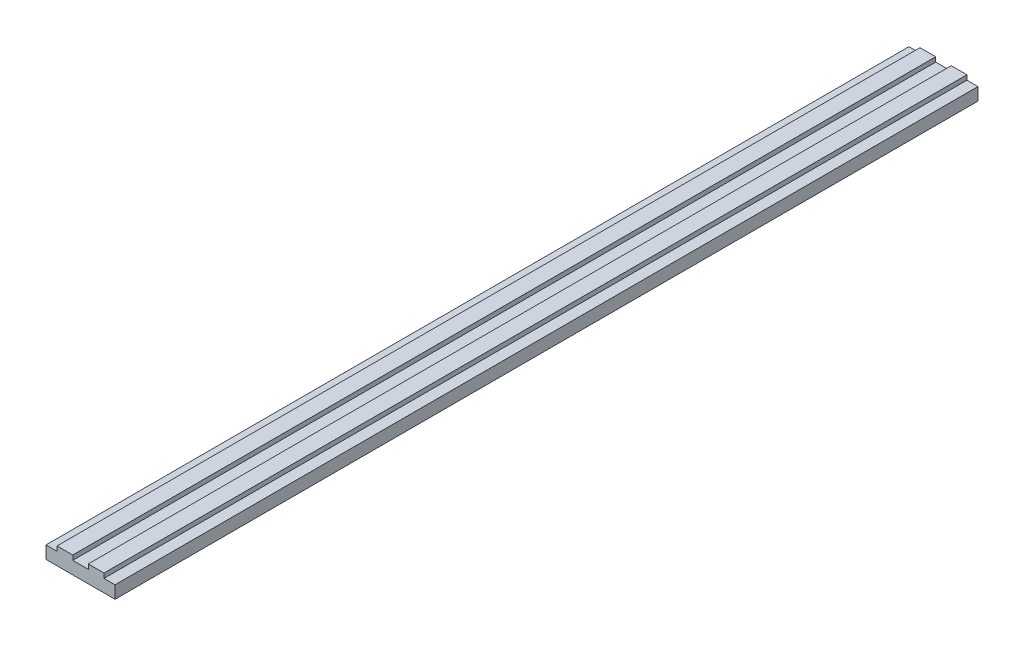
ISO-10303-21;
HEADER;
FILE_DESCRIPTION(('STEP AP214'),'2;1');
FILE_NAME('part.step','',(''),(''),'','','');
FILE_SCHEMA(('AUTOMOTIVE_DESIGN { 1 0 10303 214 1 1 1 1 }'));
ENDSEC;
DATA;
#1=APPLICATION_CONTEXT('core data for automotive mechanical design processes');
#2=APPLICATION_PROTOCOL_DEFINITION('international standard','automotive_design',2000,#1);
#3=PRODUCT_CONTEXT('',#1,'mechanical');
#4=PRODUCT('Part','Part','',(#3));
#5=PRODUCT_RELATED_PRODUCT_CATEGORY('part','',(#4));
#6=PRODUCT_DEFINITION_FORMATION('','',#4);
#7=PRODUCT_DEFINITION_CONTEXT('part definition',#1,'design');
#8=PRODUCT_DEFINITION('design','',#6,#7);
#9=PRODUCT_DEFINITION_SHAPE('','',#8);
#10=(LENGTH_UNIT() NAMED_UNIT(*) SI_UNIT(.MILLI.,.METRE.));
#11=(NAMED_UNIT(*) PLANE_ANGLE_UNIT() SI_UNIT($,.RADIAN.));
#12=(NAMED_UNIT(*) SI_UNIT($,.STERADIAN.) SOLID_ANGLE_UNIT());
#13=UNCERTAINTY_MEASURE_WITH_UNIT(LENGTH_MEASURE(1.E-05),#10,'distance_accuracy_value','');
#14=(GEOMETRIC_REPRESENTATION_CONTEXT(3) GLOBAL_UNCERTAINTY_ASSIGNED_CONTEXT((#13)) GLOBAL_UNIT_ASSIGNED_CONTEXT((#10,
#11,#12)) REPRESENTATION_CONTEXT('',''));
#15=CARTESIAN_POINT('',(0.,0.,0.));
#16=DIRECTION('',(0.,0.,1.));
#17=DIRECTION('',(1.,0.,0.));
#18=AXIS2_PLACEMENT_3D('',#15,#16,#17);
#19=CARTESIAN_POINT('',(4.5,10.,0.));
#20=DIRECTION('',(-1.,0.,0.));
#21=DIRECTION('',(0.,0.,1.));
#22=AXIS2_PLACEMENT_3D('',#19,#20,#21);
#23=PLANE('',#22);
#24=DIRECTION('',(0.,-1.,0.));
#25=VECTOR('',#24,1.);
#26=CARTESIAN_POINT('',(4.5,10.,500.));
#27=LINE('',#26,#25);
#28=CARTESIAN_POINT('',(4.5,10.,500.));
#29=VERTEX_POINT('',#28);
#30=CARTESIAN_POINT('',(4.5,7.3,500.));
#31=VERTEX_POINT('',#30);
#32=EDGE_CURVE('E135',#29,#31,#27,.T.);
#33=ORIENTED_EDGE('',*,*,#32,.F.);
#34=DIRECTION('',(0.,0.,1.));
#35=VECTOR('',#34,1.);
#36=CARTESIAN_POINT('',(4.5,10.,0.));
#37=LINE('',#36,#35);
#38=CARTESIAN_POINT('',(4.5,10.,0.));
#39=VERTEX_POINT('',#38);
#40=EDGE_CURVE('E9',#39,#29,#37,.T.);
#41=ORIENTED_EDGE('',*,*,#40,.F.);
#42=DIRECTION('',(0.,-1.,0.));
#43=VECTOR('',#42,1.);
#44=CARTESIAN_POINT('',(4.5,10.,0.));
#45=LINE('',#44,#43);
#46=CARTESIAN_POINT('',(4.5,7.3,0.));
#47=VERTEX_POINT('',#46);
#48=EDGE_CURVE('E163',#39,#47,#45,.T.);
#49=ORIENTED_EDGE('',*,*,#48,.T.);
#50=DIRECTION('',(0.,0.,1.));
#51=VECTOR('',#50,1.);
#52=CARTESIAN_POINT('',(4.5,7.3,0.));
#53=LINE('',#52,#51);
#54=EDGE_CURVE('E17',#47,#31,#53,.T.);
#55=ORIENTED_EDGE('',*,*,#54,.T.);
#56=EDGE_LOOP('',(#33,#41,#49,#55));
#57=FACE_BOUND('',#56,.T.);
#58=ADVANCED_FACE('F14',(#57),#23,.T.);
#59=CARTESIAN_POINT('',(4.5,10.,0.));
#60=DIRECTION('',(0.,-1.,0.));
#61=DIRECTION('',(0.,0.,-1.));
#62=AXIS2_PLACEMENT_3D('',#59,#60,#61);
#63=PLANE('',#62);
#64=DIRECTION('',(1.,0.,0.));
#65=VECTOR('',#64,1.);
#66=CARTESIAN_POINT('',(4.5,10.,500.));
#67=LINE('',#66,#65);
#68=CARTESIAN_POINT('',(13.6,10.,500.));
#69=VERTEX_POINT('',#68);
#70=EDGE_CURVE('E71',#29,#69,#67,.T.);
#71=ORIENTED_EDGE('',*,*,#70,.T.);
#72=DIRECTION('',(0.,0.,1.));
#73=VECTOR('',#72,1.);
#74=CARTESIAN_POINT('',(13.6,10.,0.));
#75=LINE('',#74,#73);
#76=CARTESIAN_POINT('',(13.6,10.,0.));
#77=VERTEX_POINT('',#76);
#78=EDGE_CURVE('E23',#77,#69,#75,.T.);
#79=ORIENTED_EDGE('',*,*,#78,.F.);
#80=DIRECTION('',(1.,0.,0.));
#81=VECTOR('',#80,1.);
#82=CARTESIAN_POINT('',(4.5,10.,0.));
#83=LINE('',#82,#81);
#84=EDGE_CURVE('E113',#39,#77,#83,.T.);
#85=ORIENTED_EDGE('',*,*,#84,.F.);
#86=ORIENTED_EDGE('',*,*,#40,.T.);
#87=EDGE_LOOP('',(#71,#79,#85,#86));
#88=FACE_BOUND('',#87,.T.);
#89=ADVANCED_FACE('F242',(#88),#63,.F.);
#90=CARTESIAN_POINT('',(13.6,10.,0.));
#91=DIRECTION('',(-1.,0.,0.));
#92=DIRECTION('',(0.,0.,1.));
#93=AXIS2_PLACEMENT_3D('',#90,#91,#92);
#94=PLANE('',#93);
#95=DIRECTION('',(0.,-1.,0.));
#96=VECTOR('',#95,1.);
#97=CARTESIAN_POINT('',(13.6,10.,500.));
#98=LINE('',#97,#96);
#99=CARTESIAN_POINT('',(13.6,7.3,500.));
#100=VERTEX_POINT('',#99);
#101=EDGE_CURVE('E120',#69,#100,#98,.T.);
#102=ORIENTED_EDGE('',*,*,#101,.T.);
#103=DIRECTION('',(0.,0.,1.));
#104=VECTOR('',#103,1.);
#105=CARTESIAN_POINT('',(13.6,7.3,0.));
#106=LINE('',#105,#104);
#107=CARTESIAN_POINT('',(13.6,7.3,0.));
#108=VERTEX_POINT('',#107);
#109=EDGE_CURVE('E117',#108,#100,#106,.T.);
#110=ORIENTED_EDGE('',*,*,#109,.F.);
#111=DIRECTION('',(0.,-1.,0.));
#112=VECTOR('',#111,1.);
#113=CARTESIAN_POINT('',(13.6,10.,0.));
#114=LINE('',#113,#112);
#115=EDGE_CURVE('E107',#77,#108,#114,.T.);
#116=ORIENTED_EDGE('',*,*,#115,.F.);
#117=ORIENTED_EDGE('',*,*,#78,.T.);
#118=EDGE_LOOP('',(#102,#110,#116,#117));
#119=FACE_BOUND('',#118,.T.);
#120=ADVANCED_FACE('F118',(#119),#94,.F.);
#121=CARTESIAN_POINT('',(13.6,7.3,0.));
#122=DIRECTION('',(0.,-1.,0.));
#123=DIRECTION('',(0.,0.,-1.));
#124=AXIS2_PLACEMENT_3D('',#121,#122,#123);
#125=PLANE('',#124);
#126=DIRECTION('',(1.,0.,0.));
#127=VECTOR('',#126,1.);
#128=CARTESIAN_POINT('',(13.6,7.3,500.));
#129=LINE('',#128,#127);
#130=CARTESIAN_POINT('',(20.,7.3,500.));
#131=VERTEX_POINT('',#130);
#132=EDGE_CURVE('E160',#100,#131,#129,.T.);
#133=ORIENTED_EDGE('',*,*,#132,.T.);
#134=DIRECTION('',(0.,0.,1.));
#135=VECTOR('',#134,1.);
#136=CARTESIAN_POINT('',(20.,7.3,0.));
#137=LINE('',#136,#135);
#138=CARTESIAN_POINT('',(20.,7.3,0.));
#139=VERTEX_POINT('',#138);
#140=EDGE_CURVE('E123',#139,#131,#137,.T.);
#141=ORIENTED_EDGE('',*,*,#140,.F.);
#142=DIRECTION('',(1.,0.,0.));
#143=VECTOR('',#142,1.);
#144=CARTESIAN_POINT('',(13.6,7.3,0.));
#145=LINE('',#144,#143);
#146=EDGE_CURVE('E111',#108,#139,#145,.T.);
#147=ORIENTED_EDGE('',*,*,#146,.F.);
#148=ORIENTED_EDGE('',*,*,#109,.T.);
#149=EDGE_LOOP('',(#133,#141,#147,#148));
#150=FACE_BOUND('',#149,.T.);
#151=ADVANCED_FACE('F125',(#150),#125,.F.);
#152=CARTESIAN_POINT('',(20.,7.3,0.));
#153=DIRECTION('',(-1.,0.,0.));
#154=DIRECTION('',(0.,0.,1.));
#155=AXIS2_PLACEMENT_3D('',#152,#153,#154);
#156=PLANE('',#155);
#157=DIRECTION('',(0.,-1.,0.));
#158=VECTOR('',#157,1.);
#159=CARTESIAN_POINT('',(20.,7.3,500.));
#160=LINE('',#159,#158);
#161=CARTESIAN_POINT('',(20.,0.,500.));
#162=VERTEX_POINT('',#161);
#163=EDGE_CURVE('E157',#131,#162,#160,.T.);
#164=ORIENTED_EDGE('',*,*,#163,.T.);
#165=DIRECTION('',(0.,0.,1.));
#166=VECTOR('',#165,1.);
#167=CARTESIAN_POINT('',(20.,0.,0.));
#168=LINE('',#167,#166);
#169=CARTESIAN_POINT('',(20.,0.,0.));
#170=VERTEX_POINT('',#169);
#171=EDGE_CURVE('E167',#170,#162,#168,.T.);
#172=ORIENTED_EDGE('',*,*,#171,.F.);
#173=DIRECTION('',(0.,-1.,0.));
#174=VECTOR('',#173,1.);
#175=CARTESIAN_POINT('',(20.,7.3,0.));
#176=LINE('',#175,#174);
#177=EDGE_CURVE('E128',#139,#170,#176,.T.);
#178=ORIENTED_EDGE('',*,*,#177,.F.);
#179=ORIENTED_EDGE('',*,*,#140,.T.);
#180=EDGE_LOOP('',(#164,#172,#178,#179));
#181=FACE_BOUND('',#180,.T.);
#182=ADVANCED_FACE('F190',(#181),#156,.F.);
#183=CARTESIAN_POINT('',(-20.,0.,0.));
#184=DIRECTION('',(0.,-1.,0.));
#185=DIRECTION('',(0.,0.,-1.));
#186=AXIS2_PLACEMENT_3D('',#183,#184,#185);
#187=PLANE('',#186);
#188=DIRECTION('',(1.,0.,0.));
#189=VECTOR('',#188,1.);
#190=CARTESIAN_POINT('',(-20.,0.,500.));
#191=LINE('',#190,#189);
#192=CARTESIAN_POINT('',(-20.,0.,500.));
#193=VERTEX_POINT('',#192);
#194=EDGE_CURVE('E154',#193,#162,#191,.T.);
#195=ORIENTED_EDGE('',*,*,#194,.F.);
#196=DIRECTION('',(0.,0.,1.));
#197=VECTOR('',#196,1.);
#198=CARTESIAN_POINT('',(-20.,0.,0.));
#199=LINE('',#198,#197);
#200=CARTESIAN_POINT('',(-20.,0.,0.));
#201=VERTEX_POINT('',#200);
#202=EDGE_CURVE('E169',#201,#193,#199,.T.);
#203=ORIENTED_EDGE('',*,*,#202,.F.);
#204=DIRECTION('',(1.,0.,0.));
#205=VECTOR('',#204,1.);
#206=CARTESIAN_POINT('',(-20.,0.,0.));
#207=LINE('',#206,#205);
#208=EDGE_CURVE('E130',#201,#170,#207,.T.);
#209=ORIENTED_EDGE('',*,*,#208,.T.);
#210=ORIENTED_EDGE('',*,*,#171,.T.);
#211=EDGE_LOOP('',(#195,#203,#209,#210));
#212=FACE_BOUND('',#211,.T.);
#213=ADVANCED_FACE('F230',(#212),#187,.T.);
#214=CARTESIAN_POINT('',(-20.,7.3,0.));
#215=DIRECTION('',(-1.,0.,0.));
#216=DIRECTION('',(0.,0.,1.));
#217=AXIS2_PLACEMENT_3D('',#214,#215,#216);
#218=PLANE('',#217);
#219=DIRECTION('',(0.,-1.,0.));
#220=VECTOR('',#219,1.);
#221=CARTESIAN_POINT('',(-20.,7.3,500.));
#222=LINE('',#221,#220);
#223=CARTESIAN_POINT('',(-20.,7.3,500.));
#224=VERTEX_POINT('',#223);
#225=EDGE_CURVE('E151',#224,#193,#222,.T.);
#226=ORIENTED_EDGE('',*,*,#225,.F.);
#227=DIRECTION('',(0.,0.,1.));
#228=VECTOR('',#227,1.);
#229=CARTESIAN_POINT('',(-20.,7.3,0.));
#230=LINE('',#229,#228);
#231=CARTESIAN_POINT('',(-20.,7.3,0.));
#232=VERTEX_POINT('',#231);
#233=EDGE_CURVE('E171',#232,#224,#230,.T.);
#234=ORIENTED_EDGE('',*,*,#233,.F.);
#235=DIRECTION('',(0.,-1.,0.));
#236=VECTOR('',#235,1.);
#237=CARTESIAN_POINT('',(-20.,7.3,0.));
#238=LINE('',#237,#236);
#239=EDGE_CURVE('E196',#232,#201,#238,.T.);
#240=ORIENTED_EDGE('',*,*,#239,.T.);
#241=ORIENTED_EDGE('',*,*,#202,.T.);
#242=EDGE_LOOP('',(#226,#234,#240,#241));
#243=FACE_BOUND('',#242,.T.);
#244=ADVANCED_FACE('F200',(#243),#218,.T.);
#245=CARTESIAN_POINT('',(-20.,7.3,0.));
#246=DIRECTION('',(0.,-1.,0.));
#247=DIRECTION('',(0.,0.,-1.));
#248=AXIS2_PLACEMENT_3D('',#245,#246,#247);
#249=PLANE('',#248);
#250=DIRECTION('',(1.,0.,0.));
#251=VECTOR('',#250,1.);
#252=CARTESIAN_POINT('',(-20.,7.3,500.));
#253=LINE('',#252,#251);
#254=CARTESIAN_POINT('',(-13.6,7.3,500.));
#255=VERTEX_POINT('',#254);
#256=EDGE_CURVE('E148',#224,#255,#253,.T.);
#257=ORIENTED_EDGE('',*,*,#256,.T.);
#258=DIRECTION('',(0.,0.,1.));
#259=VECTOR('',#258,1.);
#260=CARTESIAN_POINT('',(-13.6,7.3,0.));
#261=LINE('',#260,#259);
#262=CARTESIAN_POINT('',(-13.6,7.3,0.));
#263=VERTEX_POINT('',#262);
#264=EDGE_CURVE('E173',#263,#255,#261,.T.);
#265=ORIENTED_EDGE('',*,*,#264,.F.);
#266=DIRECTION('',(1.,0.,0.));
#267=VECTOR('',#266,1.);
#268=CARTESIAN_POINT('',(-20.,7.3,0.));
#269=LINE('',#268,#267);
#270=EDGE_CURVE('E203',#232,#263,#269,.T.);
#271=ORIENTED_EDGE('',*,*,#270,.F.);
#272=ORIENTED_EDGE('',*,*,#233,.T.);
#273=EDGE_LOOP('',(#257,#265,#271,#272));
#274=FACE_BOUND('',#273,.T.);
#275=ADVANCED_FACE('F229',(#274),#249,.F.);
#276=CARTESIAN_POINT('',(-13.6,10.,0.));
#277=DIRECTION('',(-1.,0.,0.));
#278=DIRECTION('',(0.,0.,1.));
#279=AXIS2_PLACEMENT_3D('',#276,#277,#278);
#280=PLANE('',#279);
#281=DIRECTION('',(0.,-1.,0.));
#282=VECTOR('',#281,1.);
#283=CARTESIAN_POINT('',(-13.6,10.,500.));
#284=LINE('',#283,#282);
#285=CARTESIAN_POINT('',(-13.6,10.,500.));
#286=VERTEX_POINT('',#285);
#287=EDGE_CURVE('E145',#286,#255,#284,.T.);
#288=ORIENTED_EDGE('',*,*,#287,.F.);
#289=DIRECTION('',(0.,0.,1.));
#290=VECTOR('',#289,1.);
#291=CARTESIAN_POINT('',(-13.6,10.,0.));
#292=LINE('',#291,#290);
#293=CARTESIAN_POINT('',(-13.6,10.,0.));
#294=VERTEX_POINT('',#293);
#295=EDGE_CURVE('E175',#294,#286,#292,.T.);
#296=ORIENTED_EDGE('',*,*,#295,.F.);
#297=DIRECTION('',(0.,-1.,0.));
#298=VECTOR('',#297,1.);
#299=CARTESIAN_POINT('',(-13.6,10.,0.));
#300=LINE('',#299,#298);
#301=EDGE_CURVE('E205',#294,#263,#300,.T.);
#302=ORIENTED_EDGE('',*,*,#301,.T.);
#303=ORIENTED_EDGE('',*,*,#264,.T.);
#304=EDGE_LOOP('',(#288,#296,#302,#303));
#305=FACE_BOUND('',#304,.T.);
#306=ADVANCED_FACE('F226',(#305),#280,.T.);
#307=CARTESIAN_POINT('',(-13.6,10.,0.));
#308=DIRECTION('',(0.,-1.,0.));
#309=DIRECTION('',(0.,0.,-1.));
#310=AXIS2_PLACEMENT_3D('',#307,#308,#309);
#311=PLANE('',#310);
#312=DIRECTION('',(1.,0.,0.));
#313=VECTOR('',#312,1.);
#314=CARTESIAN_POINT('',(-13.6,10.,500.));
#315=LINE('',#314,#313);
#316=CARTESIAN_POINT('',(-4.49999999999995,10.,500.));
#317=VERTEX_POINT('',#316);
#318=EDGE_CURVE('E143',#286,#317,#315,.T.);
#319=ORIENTED_EDGE('',*,*,#318,.T.);
#320=DIRECTION('',(0.,0.,1.));
#321=VECTOR('',#320,1.);
#322=CARTESIAN_POINT('',(-4.49999999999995,10.,0.));
#323=LINE('',#322,#321);
#324=CARTESIAN_POINT('',(-4.49999999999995,10.,0.));
#325=VERTEX_POINT('',#324);
#326=EDGE_CURVE('E177',#325,#317,#323,.T.);
#327=ORIENTED_EDGE('',*,*,#326,.F.);
#328=DIRECTION('',(1.,0.,0.));
#329=VECTOR('',#328,1.);
#330=CARTESIAN_POINT('',(-13.6,10.,0.));
#331=LINE('',#330,#329);
#332=EDGE_CURVE('E210',#294,#325,#331,.T.);
#333=ORIENTED_EDGE('',*,*,#332,.F.);
#334=ORIENTED_EDGE('',*,*,#295,.T.);
#335=EDGE_LOOP('',(#319,#327,#333,#334));
#336=FACE_BOUND('',#335,.T.);
#337=ADVANCED_FACE('F309',(#336),#311,.F.);
#338=CARTESIAN_POINT('',(-4.49999999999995,10.,0.));
#339=DIRECTION('',(-1.,0.,0.));
#340=DIRECTION('',(0.,0.,1.));
#341=AXIS2_PLACEMENT_3D('',#338,#339,#340);
#342=PLANE('',#341);
#343=DIRECTION('',(0.,-1.,0.));
#344=VECTOR('',#343,1.);
#345=CARTESIAN_POINT('',(-4.49999999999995,10.,500.));
#346=LINE('',#345,#344);
#347=CARTESIAN_POINT('',(-4.49999999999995,7.3,500.));
#348=VERTEX_POINT('',#347);
#349=EDGE_CURVE('E141',#317,#348,#346,.T.);
#350=ORIENTED_EDGE('',*,*,#349,.T.);
#351=DIRECTION('',(0.,0.,1.));
#352=VECTOR('',#351,1.);
#353=CARTESIAN_POINT('',(-4.49999999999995,7.3,0.));
#354=LINE('',#353,#352);
#355=CARTESIAN_POINT('',(-4.49999999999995,7.3,0.));
#356=VERTEX_POINT('',#355);
#357=EDGE_CURVE('E179',#356,#348,#354,.T.);
#358=ORIENTED_EDGE('',*,*,#357,.F.);
#359=DIRECTION('',(0.,-1.,0.));
#360=VECTOR('',#359,1.);
#361=CARTESIAN_POINT('',(-4.49999999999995,10.,0.));
#362=LINE('',#361,#360);
#363=EDGE_CURVE('E212',#325,#356,#362,.T.);
#364=ORIENTED_EDGE('',*,*,#363,.F.);
#365=ORIENTED_EDGE('',*,*,#326,.T.);
#366=EDGE_LOOP('',(#350,#358,#364,#365));
#367=FACE_BOUND('',#366,.T.);
#368=ADVANCED_FACE('F220',(#367),#342,.F.);
#369=CARTESIAN_POINT('',(-4.49999999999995,7.3,0.));
#370=DIRECTION('',(0.,-1.,0.));
#371=DIRECTION('',(0.,0.,-1.));
#372=AXIS2_PLACEMENT_3D('',#369,#370,#371);
#373=PLANE('',#372);
#374=DIRECTION('',(1.,0.,0.));
#375=VECTOR('',#374,1.);
#376=CARTESIAN_POINT('',(-4.49999999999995,7.3,500.));
#377=LINE('',#376,#375);
#378=EDGE_CURVE('E138',#348,#31,#377,.T.);
#379=ORIENTED_EDGE('',*,*,#378,.T.);
#380=ORIENTED_EDGE('',*,*,#54,.F.);
#381=DIRECTION('',(1.,0.,0.));
#382=VECTOR('',#381,1.);
#383=CARTESIAN_POINT('',(-4.49999999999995,7.3,0.));
#384=LINE('',#383,#382);
#385=EDGE_CURVE('E81',#356,#47,#384,.T.);
#386=ORIENTED_EDGE('',*,*,#385,.F.);
#387=ORIENTED_EDGE('',*,*,#357,.T.);
#388=EDGE_LOOP('',(#379,#380,#386,#387));
#389=FACE_BOUND('',#388,.T.);
#390=ADVANCED_FACE('F184',(#389),#373,.F.);
#391=CARTESIAN_POINT('',(4.5,7.3,0.));
#392=DIRECTION('',(0.,0.,1.));
#393=DIRECTION('',(1.,0.,0.));
#394=AXIS2_PLACEMENT_3D('',#391,#392,#393);
#395=PLANE('',#394);
#396=ORIENTED_EDGE('',*,*,#48,.F.);
#397=ORIENTED_EDGE('',*,*,#84,.T.);
#398=ORIENTED_EDGE('',*,*,#115,.T.);
#399=ORIENTED_EDGE('',*,*,#146,.T.);
#400=ORIENTED_EDGE('',*,*,#177,.T.);
#401=ORIENTED_EDGE('',*,*,#208,.F.);
#402=ORIENTED_EDGE('',*,*,#239,.F.);
#403=ORIENTED_EDGE('',*,*,#270,.T.);
#404=ORIENTED_EDGE('',*,*,#301,.F.);
#405=ORIENTED_EDGE('',*,*,#332,.T.);
#406=ORIENTED_EDGE('',*,*,#363,.T.);
#407=ORIENTED_EDGE('',*,*,#385,.T.);
#408=EDGE_LOOP('',(#396,#397,#398,#399,#400,#401,#402,#403,#404,#405,#406,#407));
#409=FACE_BOUND('',#408,.T.);
#410=ADVANCED_FACE('F109',(#409),#395,.F.);
#411=CARTESIAN_POINT('',(4.5,7.3,500.));
#412=DIRECTION('',(0.,0.,1.));
#413=DIRECTION('',(1.,0.,0.));
#414=AXIS2_PLACEMENT_3D('',#411,#412,#413);
#415=PLANE('',#414);
#416=ORIENTED_EDGE('',*,*,#32,.T.);
#417=ORIENTED_EDGE('',*,*,#378,.F.);
#418=ORIENTED_EDGE('',*,*,#349,.F.);
#419=ORIENTED_EDGE('',*,*,#318,.F.);
#420=ORIENTED_EDGE('',*,*,#287,.T.);
#421=ORIENTED_EDGE('',*,*,#256,.F.);
#422=ORIENTED_EDGE('',*,*,#225,.T.);
#423=ORIENTED_EDGE('',*,*,#194,.T.);
#424=ORIENTED_EDGE('',*,*,#163,.F.);
#425=ORIENTED_EDGE('',*,*,#132,.F.);
#426=ORIENTED_EDGE('',*,*,#101,.F.);
#427=ORIENTED_EDGE('',*,*,#70,.F.);
#428=EDGE_LOOP('',(#416,#417,#418,#419,#420,#421,#422,#423,#424,#425,#426,#427));
#429=FACE_BOUND('',#428,.T.);
#430=ADVANCED_FACE('F187',(#429),#415,.T.);
#431=CLOSED_SHELL('',(#58,#89,#120,#151,#182,#213,#244,#275,#306,#337,#368,#390,#410,#430));
#432=MANIFOLD_SOLID_BREP('B1',#431);
#433=ADVANCED_BREP_SHAPE_REPRESENTATION('',(#18,#432),#14);
#434=SHAPE_DEFINITION_REPRESENTATION(#9,#433);
ENDSEC;
END-ISO-10303-21;
